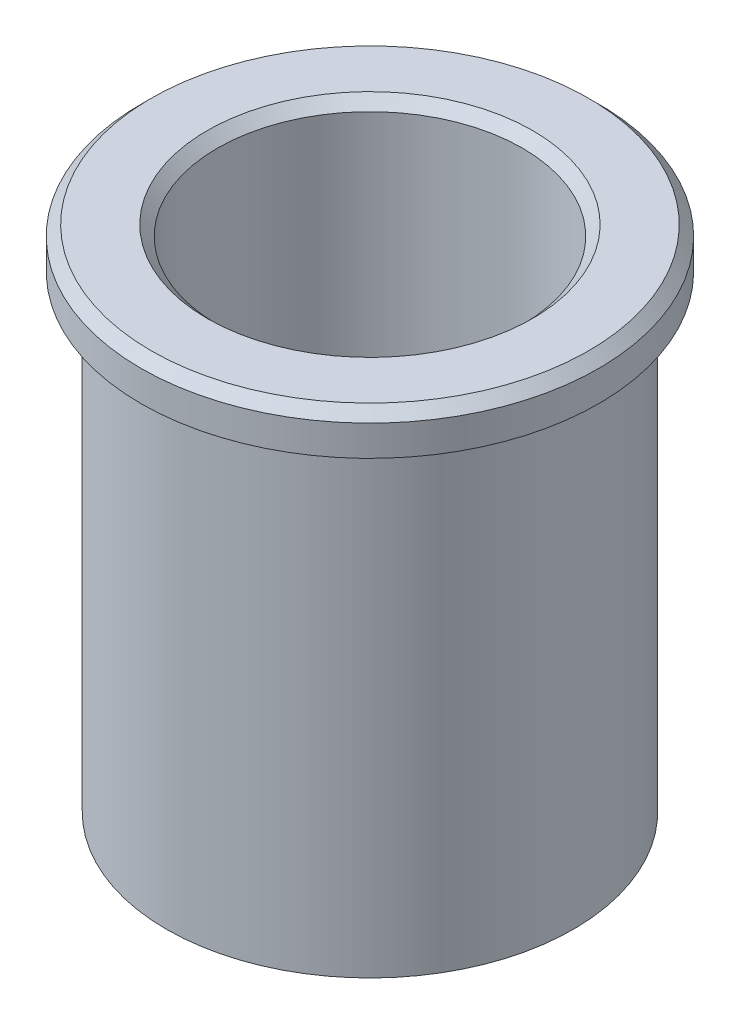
from build123d import *


with BuildPart() as part:
    # Esquisse1 → R_volution1 (revolve)
    with BuildSketch(Plane.XY, mode=Mode.PRIVATE) as r_volution1_sk:
        Polygon((16, 0), (21.5, 0), (22.5, -1), (22.5, -4), (20, -4), (20, -50), (16, -50), (15, -49), (15, -1), align=None)
    revolve(r_volution1_sk.sketch.rotate(Axis((0, 22.616438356, 0), (0, -1, 0)), 90), axis=Axis((0, 22.616438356, 0), (0, -1, 0)))


solid = part.part
